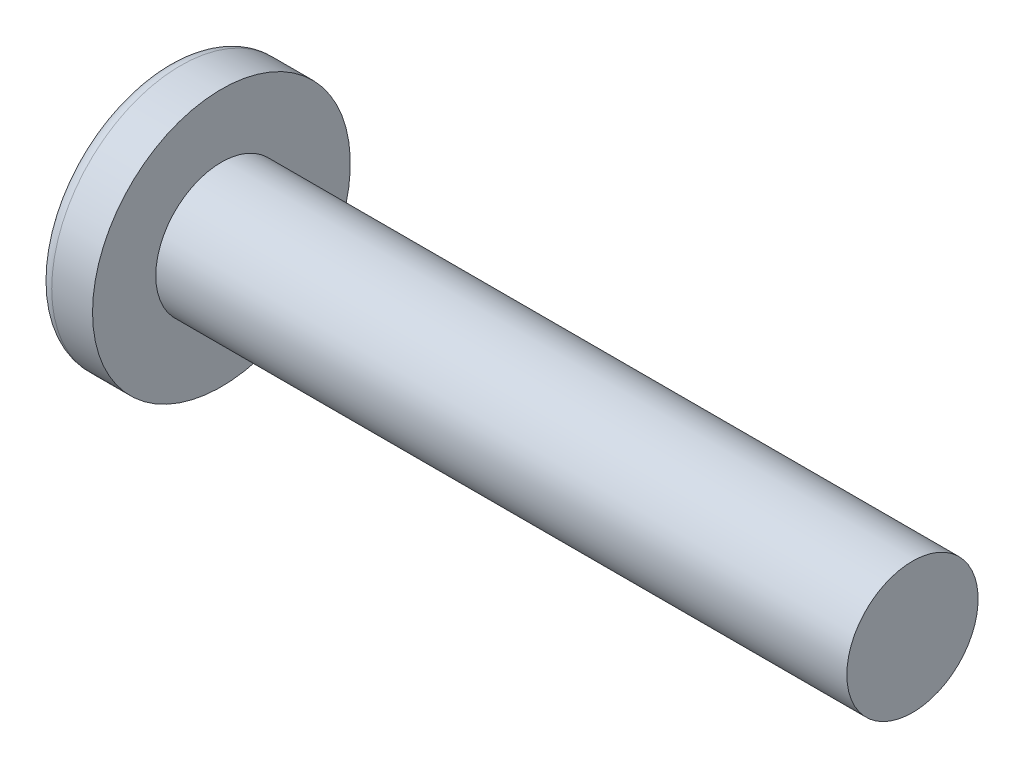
from build123d import *

# Parameters (mm, degrees)
CIRPATTERN1_COUNT = 2
CIRPATTERN1_ANGLE = 90


with BuildPart() as part:
    # BodySke → Base-Revolve (revolve)
    with BuildSketch(Plane.XY, mode=Mode.PRIVATE) as base_revolve_sk:
        with BuildLine():
            Line((3.3782, 2.413), (3.3782, 4.7371))
            Line((3.3782, 4.7371), (1.87773671, 4.7371))
            ThreePointArc((1.87773671, 4.7371), (1.646685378, 4.681514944), (1.466197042, 4.526923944))
            ThreePointArc((1.466197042, 4.526923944), (0.375688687, 2.379221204), (0, 0))
            Line((0, 0), (28.7782, 0))
            Line((28.7782, 0), (28.7782, 2.413))
            Line((28.7782, 2.413), (3.3782, 2.413))
        make_face()
    revolve(base_revolve_sk.sketch.rotate(Axis((-25.4, 0, 0), (1, 0, 0)), 90), axis=Axis((-25.4, 0, 0), (1, 0, 0)))

    # Sketch3 → Cut-Loft1 section 0
    with BuildSketch(Plane(origin=(0, 0, 0), x_dir=(0, 0, -1), z_dir=(1, 0, 0))):
        with BuildLine():
            Line((0.5842, -3.048), (-0.5842, -3.048))
            Line((-0.5842, -3.048), (-0.5842, 3.048))
            Line((-0.5842, 3.048), (0.5842, 3.048))
            Line((0.5842, 3.048), (0.5842, -3.048))
        make_face()
    # Sketch4 → Cut-Loft1 section 1
    with BuildSketch(Plane(origin=(3.4798, 0, 0), x_dir=(0, 0, -1), z_dir=(1, 0, 0))):
        with BuildLine():
            Line((0.2921, -0.2921), (-0.2921, -0.2921))
            Line((-0.2921, -0.2921), (-0.2921, 0.2921))
            Line((-0.2921, 0.2921), (0.2921, 0.2921))
            Line((0.2921, 0.2921), (0.2921, -0.2921))
        make_face()
    cut_loft1 = loft(mode=Mode.SUBTRACT)

    # CirPattern1: Cut-Loft1 ×2 about axis
    cirpattern1_axis = Axis((0, 0, 0), (1, 0, 0))
    for i in range(1, CIRPATTERN1_COUNT):
        add(cut_loft1.rotate(cirpattern1_axis, i * CIRPATTERN1_ANGLE / (CIRPATTERN1_COUNT - 1)), mode=Mode.SUBTRACT)


solid = part.part
